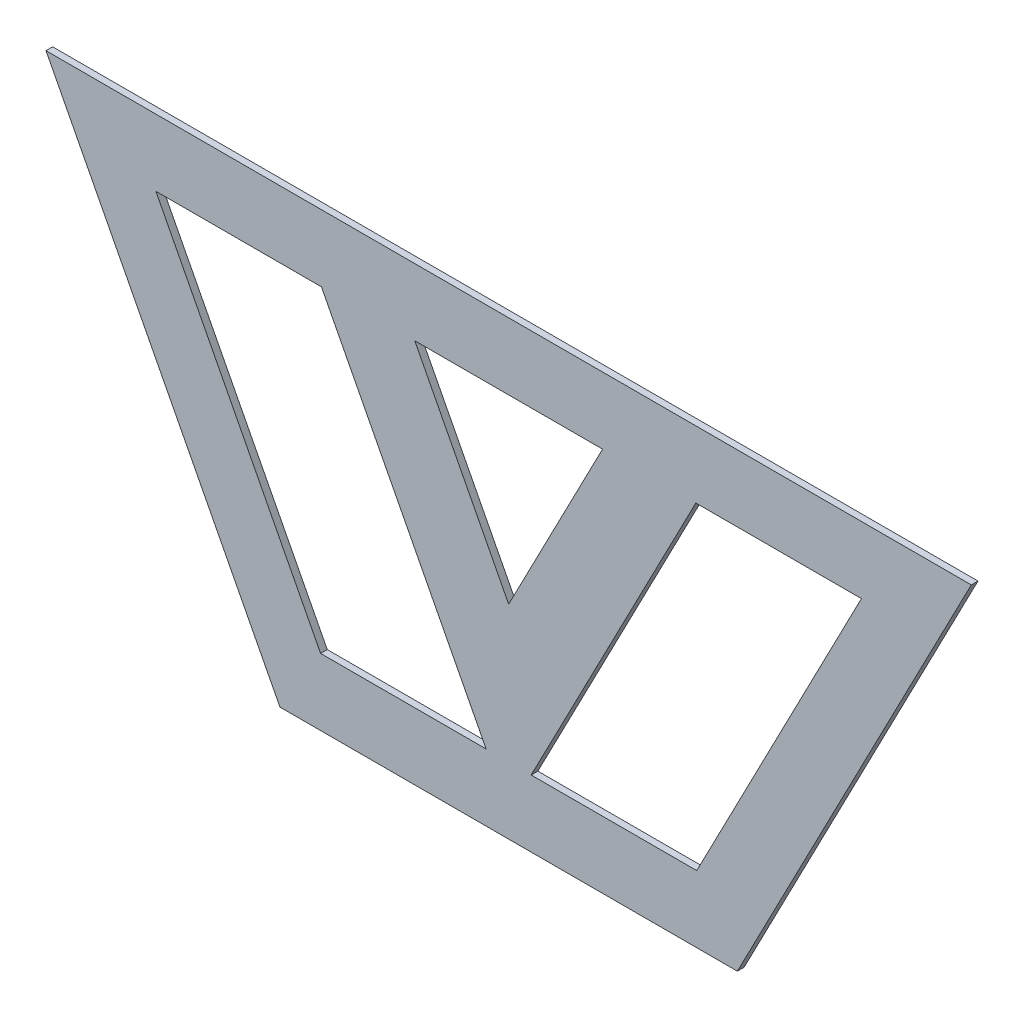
from build123d import *

# Parameters (mm, degrees)
BOSS_EXTRUDE1_DEPTH = 6.35


with BuildPart() as part:
    # Model → Boss-Extrude1 (new body)
    with BuildSketch(Plane.XY):
        Polygon((178.483635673, 612.477004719), (-256.21626799, 612.477004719), (-478.53383154, 1041.555735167), (400.801199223, 1041.555735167), align=None)
        Polygon((-217.600014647, 675.977004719), (-374.115363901, 978.055735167), (-216.777170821, 978.055735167), (-60.261821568, 675.977004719), align=None, mode=Mode.SUBTRACT)
        Polygon((139.86738233, 675.977004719), (296.382731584, 978.055735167), (139.044538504, 978.055735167), (-17.47081075, 675.977004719), align=None, mode=Mode.SUBTRACT)
        Polygon((-38.866316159, 805.840791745), (-128.095643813, 978.055735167), (50.363011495, 978.055735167), align=None, mode=Mode.SUBTRACT)
    extrude(amount=BOSS_EXTRUDE1_DEPTH)


solid = part.part
